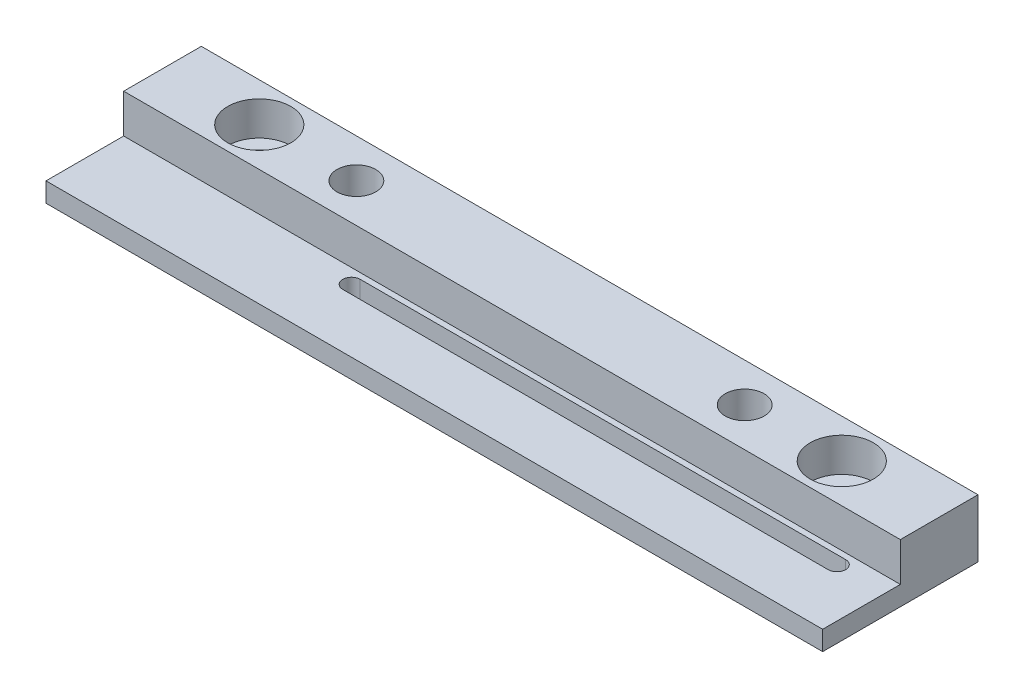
ISO-10303-21;
HEADER;
FILE_DESCRIPTION(('STEP AP214'),'2;1');
FILE_NAME('part.step','',(''),(''),'','','');
FILE_SCHEMA(('AUTOMOTIVE_DESIGN { 1 0 10303 214 1 1 1 1 }'));
ENDSEC;
DATA;
#1=APPLICATION_CONTEXT('core data for automotive mechanical design processes');
#2=APPLICATION_PROTOCOL_DEFINITION('international standard','automotive_design',2000,#1);
#3=PRODUCT_CONTEXT('',#1,'mechanical');
#4=PRODUCT('Part','Part','',(#3));
#5=PRODUCT_RELATED_PRODUCT_CATEGORY('part','',(#4));
#6=PRODUCT_DEFINITION_FORMATION('','',#4);
#7=PRODUCT_DEFINITION_CONTEXT('part definition',#1,'design');
#8=PRODUCT_DEFINITION('design','',#6,#7);
#9=PRODUCT_DEFINITION_SHAPE('','',#8);
#10=(LENGTH_UNIT() NAMED_UNIT(*) SI_UNIT(.MILLI.,.METRE.));
#11=(NAMED_UNIT(*) PLANE_ANGLE_UNIT() SI_UNIT($,.RADIAN.));
#12=(NAMED_UNIT(*) SI_UNIT($,.STERADIAN.) SOLID_ANGLE_UNIT());
#13=UNCERTAINTY_MEASURE_WITH_UNIT(LENGTH_MEASURE(1.E-05),#10,'distance_accuracy_value','');
#14=(GEOMETRIC_REPRESENTATION_CONTEXT(3) GLOBAL_UNCERTAINTY_ASSIGNED_CONTEXT((#13)) GLOBAL_UNIT_ASSIGNED_CONTEXT((#10,
#11,#12)) REPRESENTATION_CONTEXT('',''));
#15=CARTESIAN_POINT('',(0.,0.,0.));
#16=DIRECTION('',(0.,0.,1.));
#17=DIRECTION('',(1.,0.,0.));
#18=AXIS2_PLACEMENT_3D('',#15,#16,#17);
#19=CARTESIAN_POINT('',(80.,-2.27373675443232E-13,16.));
#20=DIRECTION('',(-1.,0.,0.));
#21=DIRECTION('',(0.,0.,1.));
#22=AXIS2_PLACEMENT_3D('',#19,#20,#21);
#23=PLANE('',#22);
#24=DIRECTION('',(0.,1.,0.));
#25=VECTOR('',#24,1.);
#26=CARTESIAN_POINT('',(80.,-2.27373675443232E-13,8.));
#27=LINE('',#26,#25);
#28=CARTESIAN_POINT('',(80.,2.,8.));
#29=VERTEX_POINT('',#28);
#30=CARTESIAN_POINT('',(80.,6.,8.));
#31=VERTEX_POINT('',#30);
#32=EDGE_CURVE('E124',#29,#31,#27,.T.);
#33=ORIENTED_EDGE('',*,*,#32,.F.);
#34=DIRECTION('',(0.,0.,-1.));
#35=VECTOR('',#34,1.);
#36=CARTESIAN_POINT('',(80.,2.,16.));
#37=LINE('',#36,#35);
#38=CARTESIAN_POINT('',(80.,2.,16.));
#39=VERTEX_POINT('',#38);
#40=EDGE_CURVE('E111',#39,#29,#37,.T.);
#41=ORIENTED_EDGE('',*,*,#40,.F.);
#42=DIRECTION('',(0.,1.,0.));
#43=VECTOR('',#42,1.);
#44=CARTESIAN_POINT('',(80.,-2.27373675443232E-13,16.));
#45=LINE('',#44,#43);
#46=CARTESIAN_POINT('',(80.,-2.27373675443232E-13,16.));
#47=VERTEX_POINT('',#46);
#48=EDGE_CURVE('E121',#47,#39,#45,.T.);
#49=ORIENTED_EDGE('',*,*,#48,.F.);
#50=DIRECTION('',(0.,0.,-1.));
#51=VECTOR('',#50,1.);
#52=CARTESIAN_POINT('',(80.,-2.27373675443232E-13,16.));
#53=LINE('',#52,#51);
#54=CARTESIAN_POINT('',(80.,-2.27373675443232E-13,0.));
#55=VERTEX_POINT('',#54);
#56=EDGE_CURVE('E155',#47,#55,#53,.T.);
#57=ORIENTED_EDGE('',*,*,#56,.T.);
#58=DIRECTION('',(0.,1.,0.));
#59=VECTOR('',#58,1.);
#60=CARTESIAN_POINT('',(80.,-2.27373675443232E-13,0.));
#61=LINE('',#60,#59);
#62=CARTESIAN_POINT('',(80.,5.99999999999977,0.));
#63=VERTEX_POINT('',#62);
#64=EDGE_CURVE('E141',#55,#63,#61,.T.);
#65=ORIENTED_EDGE('',*,*,#64,.T.);
#66=DIRECTION('',(0.,0.,-1.));
#67=VECTOR('',#66,1.);
#68=CARTESIAN_POINT('',(80.,5.99999999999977,16.));
#69=LINE('',#68,#67);
#70=EDGE_CURVE('E153',#31,#63,#69,.T.);
#71=ORIENTED_EDGE('',*,*,#70,.F.);
#72=EDGE_LOOP('',(#33,#41,#49,#57,#65,#71));
#73=FACE_BOUND('',#72,.T.);
#74=ADVANCED_FACE('F32',(#73),#23,.F.);
#75=CARTESIAN_POINT('',(0.,5.99999999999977,16.));
#76=DIRECTION('',(0.,-1.,0.));
#77=DIRECTION('',(0.,0.,-1.));
#78=AXIS2_PLACEMENT_3D('',#75,#76,#77);
#79=PLANE('',#78);
#80=CARTESIAN_POINT('',(19.968687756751,5.99999999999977,4.));
#81=DIRECTION('',(0.,1.,0.));
#82=DIRECTION('',(0.,0.,1.));
#83=AXIS2_PLACEMENT_3D('',#80,#81,#82);
#84=CIRCLE('',#83,2.);
#85=CARTESIAN_POINT('',(19.968687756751,5.99999999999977,6.));
#86=VERTEX_POINT('',#85);
#87=EDGE_CURVE('E207',#86,#86,#84,.T.);
#88=ORIENTED_EDGE('',*,*,#87,.F.);
#89=EDGE_LOOP('',(#88));
#90=FACE_BOUND('',#89,.T.);
#91=CARTESIAN_POINT('',(59.968687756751,5.99999999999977,4.));
#92=DIRECTION('',(0.,1.,0.));
#93=DIRECTION('',(0.,0.,1.));
#94=AXIS2_PLACEMENT_3D('',#91,#92,#93);
#95=CIRCLE('',#94,2.);
#96=CARTESIAN_POINT('',(59.968687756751,5.99999999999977,6.));
#97=VERTEX_POINT('',#96);
#98=EDGE_CURVE('E201',#97,#97,#95,.T.);
#99=ORIENTED_EDGE('',*,*,#98,.F.);
#100=EDGE_LOOP('',(#99));
#101=FACE_BOUND('',#100,.T.);
#102=CARTESIAN_POINT('',(9.96868775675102,5.99999999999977,4.));
#103=DIRECTION('',(0.,1.,0.));
#104=DIRECTION('',(0.,0.,1.));
#105=AXIS2_PLACEMENT_3D('',#102,#103,#104);
#106=CIRCLE('',#105,3.25);
#107=CARTESIAN_POINT('',(9.96868775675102,5.99999999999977,7.25));
#108=VERTEX_POINT('',#107);
#109=EDGE_CURVE('E164',#108,#108,#106,.T.);
#110=ORIENTED_EDGE('',*,*,#109,.F.);
#111=EDGE_LOOP('',(#110));
#112=FACE_BOUND('',#111,.T.);
#113=CARTESIAN_POINT('',(69.968687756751,5.99999999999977,4.));
#114=DIRECTION('',(0.,1.,0.));
#115=DIRECTION('',(0.,0.,1.));
#116=AXIS2_PLACEMENT_3D('',#113,#114,#115);
#117=CIRCLE('',#116,3.25);
#118=CARTESIAN_POINT('',(69.968687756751,5.99999999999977,7.25));
#119=VERTEX_POINT('',#118);
#120=EDGE_CURVE('E413',#119,#119,#117,.T.);
#121=ORIENTED_EDGE('',*,*,#120,.F.);
#122=EDGE_LOOP('',(#121));
#123=FACE_BOUND('',#122,.T.);
#124=DIRECTION('',(-1.,0.,0.));
#125=VECTOR('',#124,1.);
#126=CARTESIAN_POINT('',(196.982446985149,6.,8.));
#127=LINE('',#126,#125);
#128=CARTESIAN_POINT('',(0.,6.,8.));
#129=VERTEX_POINT('',#128);
#130=EDGE_CURVE('E404',#31,#129,#127,.T.);
#131=ORIENTED_EDGE('',*,*,#130,.F.);
#132=ORIENTED_EDGE('',*,*,#70,.T.);
#133=DIRECTION('',(-1.,0.,0.));
#134=VECTOR('',#133,1.);
#135=CARTESIAN_POINT('',(0.,5.99999999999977,0.));
#136=LINE('',#135,#134);
#137=CARTESIAN_POINT('',(0.,5.99999999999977,0.));
#138=VERTEX_POINT('',#137);
#139=EDGE_CURVE('E145',#63,#138,#136,.T.);
#140=ORIENTED_EDGE('',*,*,#139,.T.);
#141=DIRECTION('',(0.,0.,-1.));
#142=VECTOR('',#141,1.);
#143=CARTESIAN_POINT('',(0.,5.99999999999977,16.));
#144=LINE('',#143,#142);
#145=EDGE_CURVE('E151',#129,#138,#144,.T.);
#146=ORIENTED_EDGE('',*,*,#145,.F.);
#147=EDGE_LOOP('',(#131,#132,#140,#146));
#148=FACE_BOUND('',#147,.T.);
#149=ADVANCED_FACE('F246',(#90,#101,#112,#123,#148),#79,.F.);
#150=CARTESIAN_POINT('',(0.,-1.13686837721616E-13,16.));
#151=DIRECTION('',(1.,0.,0.));
#152=DIRECTION('',(0.,0.,-1.));
#153=AXIS2_PLACEMENT_3D('',#150,#151,#152);
#154=PLANE('',#153);
#155=DIRECTION('',(0.,-1.,0.));
#156=VECTOR('',#155,1.);
#157=CARTESIAN_POINT('',(0.,-1.13686837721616E-13,8.));
#158=LINE('',#157,#156);
#159=CARTESIAN_POINT('',(0.,2.,8.));
#160=VERTEX_POINT('',#159);
#161=EDGE_CURVE('E11',#129,#160,#158,.T.);
#162=ORIENTED_EDGE('',*,*,#161,.F.);
#163=ORIENTED_EDGE('',*,*,#145,.T.);
#164=DIRECTION('',(0.,-1.,0.));
#165=VECTOR('',#164,1.);
#166=CARTESIAN_POINT('',(0.,-1.13686837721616E-13,0.));
#167=LINE('',#166,#165);
#168=CARTESIAN_POINT('',(0.,-1.13686837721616E-13,0.));
#169=VERTEX_POINT('',#168);
#170=EDGE_CURVE('E134',#138,#169,#167,.T.);
#171=ORIENTED_EDGE('',*,*,#170,.T.);
#172=DIRECTION('',(0.,0.,-1.));
#173=VECTOR('',#172,1.);
#174=CARTESIAN_POINT('',(0.,-1.13686837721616E-13,16.));
#175=LINE('',#174,#173);
#176=CARTESIAN_POINT('',(0.,-1.13686837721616E-13,16.));
#177=VERTEX_POINT('',#176);
#178=EDGE_CURVE('E132',#177,#169,#175,.T.);
#179=ORIENTED_EDGE('',*,*,#178,.F.);
#180=DIRECTION('',(0.,-1.,0.));
#181=VECTOR('',#180,1.);
#182=CARTESIAN_POINT('',(0.,-1.13686837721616E-13,16.));
#183=LINE('',#182,#181);
#184=CARTESIAN_POINT('',(0.,2.,16.));
#185=VERTEX_POINT('',#184);
#186=EDGE_CURVE('E130',#185,#177,#183,.T.);
#187=ORIENTED_EDGE('',*,*,#186,.F.);
#188=DIRECTION('',(0.,0.,1.));
#189=VECTOR('',#188,1.);
#190=CARTESIAN_POINT('',(0.,2.,16.));
#191=LINE('',#190,#189);
#192=EDGE_CURVE('E47',#160,#185,#191,.T.);
#193=ORIENTED_EDGE('',*,*,#192,.F.);
#194=EDGE_LOOP('',(#162,#163,#171,#179,#187,#193));
#195=FACE_BOUND('',#194,.T.);
#196=ADVANCED_FACE('F250',(#195),#154,.F.);
#197=CARTESIAN_POINT('',(80.,-2.27373675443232E-13,16.));
#198=DIRECTION('',(0.,0.,1.));
#199=DIRECTION('',(1.,0.,0.));
#200=AXIS2_PLACEMENT_3D('',#197,#198,#199);
#201=PLANE('',#200);
#202=ORIENTED_EDGE('',*,*,#48,.T.);
#203=DIRECTION('',(-1.,0.,0.));
#204=VECTOR('',#203,1.);
#205=CARTESIAN_POINT('',(196.982446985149,2.,16.));
#206=LINE('',#205,#204);
#207=EDGE_CURVE('E108',#39,#185,#206,.T.);
#208=ORIENTED_EDGE('',*,*,#207,.T.);
#209=ORIENTED_EDGE('',*,*,#186,.T.);
#210=DIRECTION('',(1.,0.,0.));
#211=VECTOR('',#210,1.);
#212=CARTESIAN_POINT('',(0.,-1.13686837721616E-13,16.));
#213=LINE('',#212,#211);
#214=EDGE_CURVE('E128',#177,#47,#213,.T.);
#215=ORIENTED_EDGE('',*,*,#214,.T.);
#216=EDGE_LOOP('',(#202,#208,#209,#215));
#217=FACE_BOUND('',#216,.T.);
#218=ADVANCED_FACE('F126',(#217),#201,.T.);
#219=CARTESIAN_POINT('',(74.968687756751,-10.0000000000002,9.5));
#220=DIRECTION('',(0.,1.,0.));
#221=DIRECTION('',(0.,0.,1.));
#222=AXIS2_PLACEMENT_3D('',#219,#220,#221);
#223=CYLINDRICAL_SURFACE('',#222,0.899999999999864);
#224=CARTESIAN_POINT('',(74.968687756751,2.,9.5));
#225=DIRECTION('',(0.,1.,0.));
#226=DIRECTION('',(0.,0.,1.));
#227=AXIS2_PLACEMENT_3D('',#224,#225,#226);
#228=CIRCLE('',#227,0.899999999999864);
#229=CARTESIAN_POINT('',(74.968687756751,2.,8.60000000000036));
#230=VERTEX_POINT('',#229);
#231=CARTESIAN_POINT('',(74.968687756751,2.,10.4000000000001));
#232=VERTEX_POINT('',#231);
#233=EDGE_CURVE('E171',#230,#232,#228,.F.);
#234=ORIENTED_EDGE('',*,*,#233,.F.);
#235=DIRECTION('',(0.,1.,0.));
#236=VECTOR('',#235,1.);
#237=CARTESIAN_POINT('',(74.968687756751,-10.0000000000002,8.60000000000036));
#238=LINE('',#237,#236);
#239=CARTESIAN_POINT('',(74.968687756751,-1.83880688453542E-13,8.60000000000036));
#240=VERTEX_POINT('',#239);
#241=EDGE_CURVE('E160',#240,#230,#238,.T.);
#242=ORIENTED_EDGE('',*,*,#241,.F.);
#243=CARTESIAN_POINT('',(74.968687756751,-2.20309881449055E-13,9.5));
#244=DIRECTION('',(0.,1.,0.));
#245=DIRECTION('',(-1.,0.,0.));
#246=AXIS2_PLACEMENT_3D('',#243,#244,#245);
#247=CIRCLE('',#246,0.899999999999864);
#248=CARTESIAN_POINT('',(74.968687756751,-1.83880688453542E-13,10.4000000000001));
#249=VERTEX_POINT('',#248);
#250=EDGE_CURVE('E198',#249,#240,#247,.T.);
#251=ORIENTED_EDGE('',*,*,#250,.F.);
#252=DIRECTION('',(0.,1.,0.));
#253=VECTOR('',#252,1.);
#254=CARTESIAN_POINT('',(74.968687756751,-10.0000000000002,10.4000000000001));
#255=LINE('',#254,#253);
#256=EDGE_CURVE('E187',#249,#232,#255,.T.);
#257=ORIENTED_EDGE('',*,*,#256,.T.);
#258=EDGE_LOOP('',(#234,#242,#251,#257));
#259=FACE_BOUND('',#258,.T.);
#260=ADVANCED_FACE('F262',(#259),#223,.F.);
#261=CARTESIAN_POINT('',(24.968687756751,-10.0000000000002,10.4));
#262=DIRECTION('',(0.,0.,1.));
#263=DIRECTION('',(1.,0.,0.));
#264=AXIS2_PLACEMENT_3D('',#261,#262,#263);
#265=PLANE('',#264);
#266=DIRECTION('',(-1.,0.,0.));
#267=VECTOR('',#266,1.);
#268=CARTESIAN_POINT('',(24.968687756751,2.,10.4));
#269=LINE('',#268,#267);
#270=CARTESIAN_POINT('',(24.968687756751,2.,10.3999999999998));
#271=VERTEX_POINT('',#270);
#272=EDGE_CURVE('E55',#232,#271,#269,.T.);
#273=ORIENTED_EDGE('',*,*,#272,.F.);
#274=ORIENTED_EDGE('',*,*,#256,.F.);
#275=DIRECTION('',(1.,0.,0.));
#276=VECTOR('',#275,1.);
#277=CARTESIAN_POINT('',(0.,-1.13686837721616E-13,10.3999999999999));
#278=LINE('',#277,#276);
#279=CARTESIAN_POINT('',(24.968687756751,-1.47451495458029E-13,10.3999999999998));
#280=VERTEX_POINT('',#279);
#281=EDGE_CURVE('E195',#280,#249,#278,.T.);
#282=ORIENTED_EDGE('',*,*,#281,.F.);
#283=DIRECTION('',(0.,1.,0.));
#284=VECTOR('',#283,1.);
#285=CARTESIAN_POINT('',(24.968687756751,-10.0000000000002,10.3999999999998));
#286=LINE('',#285,#284);
#287=EDGE_CURVE('E185',#280,#271,#286,.T.);
#288=ORIENTED_EDGE('',*,*,#287,.T.);
#289=EDGE_LOOP('',(#273,#274,#282,#288));
#290=FACE_BOUND('',#289,.T.);
#291=ADVANCED_FACE('F272',(#290),#265,.F.);
#292=CARTESIAN_POINT('',(24.968687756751,-10.0000000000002,9.5));
#293=DIRECTION('',(0.,1.,0.));
#294=DIRECTION('',(0.,0.,1.));
#295=AXIS2_PLACEMENT_3D('',#292,#293,#294);
#296=CYLINDRICAL_SURFACE('',#295,0.899999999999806);
#297=CARTESIAN_POINT('',(24.968687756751,2.,9.5));
#298=DIRECTION('',(0.,1.,0.));
#299=DIRECTION('',(0.,0.,1.));
#300=AXIS2_PLACEMENT_3D('',#297,#298,#299);
#301=CIRCLE('',#300,0.899999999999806);
#302=CARTESIAN_POINT('',(24.968687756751,2.,8.60000000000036));
#303=VERTEX_POINT('',#302);
#304=EDGE_CURVE('E172',#271,#303,#301,.F.);
#305=ORIENTED_EDGE('',*,*,#304,.F.);
#306=ORIENTED_EDGE('',*,*,#287,.F.);
#307=CARTESIAN_POINT('',(24.968687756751,-1.49186218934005E-13,9.5));
#308=DIRECTION('',(0.,1.,0.));
#309=DIRECTION('',(-1.,0.,0.));
#310=AXIS2_PLACEMENT_3D('',#307,#308,#309);
#311=CIRCLE('',#310,0.899999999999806);
#312=CARTESIAN_POINT('',(24.968687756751,-1.49169477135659E-13,8.60000000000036));
#313=VERTEX_POINT('',#312);
#314=EDGE_CURVE('E183',#313,#280,#311,.T.);
#315=ORIENTED_EDGE('',*,*,#314,.F.);
#316=DIRECTION('',(0.,1.,0.));
#317=VECTOR('',#316,1.);
#318=CARTESIAN_POINT('',(24.968687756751,-10.0000000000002,8.60000000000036));
#319=LINE('',#318,#317);
#320=EDGE_CURVE('E176',#313,#303,#319,.T.);
#321=ORIENTED_EDGE('',*,*,#320,.T.);
#322=EDGE_LOOP('',(#305,#306,#315,#321));
#323=FACE_BOUND('',#322,.T.);
#324=ADVANCED_FACE('F180',(#323),#296,.F.);
#325=CARTESIAN_POINT('',(74.968687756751,-10.0000000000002,8.60000000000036));
#326=DIRECTION('',(0.,0.,-1.));
#327=DIRECTION('',(-1.,0.,0.));
#328=AXIS2_PLACEMENT_3D('',#325,#326,#327);
#329=PLANE('',#328);
#330=DIRECTION('',(1.,0.,0.));
#331=VECTOR('',#330,1.);
#332=CARTESIAN_POINT('',(74.968687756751,2.,8.60000000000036));
#333=LINE('',#332,#331);
#334=EDGE_CURVE('E40',#303,#230,#333,.T.);
#335=ORIENTED_EDGE('',*,*,#334,.F.);
#336=ORIENTED_EDGE('',*,*,#320,.F.);
#337=DIRECTION('',(-1.,0.,0.));
#338=VECTOR('',#337,1.);
#339=CARTESIAN_POINT('',(0.,-1.13686837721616E-13,8.60000000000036));
#340=LINE('',#339,#338);
#341=EDGE_CURVE('E192',#240,#313,#340,.T.);
#342=ORIENTED_EDGE('',*,*,#341,.F.);
#343=ORIENTED_EDGE('',*,*,#241,.T.);
#344=EDGE_LOOP('',(#335,#336,#342,#343));
#345=FACE_BOUND('',#344,.T.);
#346=ADVANCED_FACE('F175',(#345),#329,.F.);
#347=CARTESIAN_POINT('',(69.968687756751,-10.0000000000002,4.));
#348=DIRECTION('',(0.,1.,0.));
#349=DIRECTION('',(0.,0.,1.));
#350=AXIS2_PLACEMENT_3D('',#347,#348,#349);
#351=CYLINDRICAL_SURFACE('',#350,1.75);
#352=CARTESIAN_POINT('',(69.968687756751,-2.13370987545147E-13,4.));
#353=DIRECTION('',(0.,1.,0.));
#354=DIRECTION('',(-1.,0.,0.));
#355=AXIS2_PLACEMENT_3D('',#352,#353,#354);
#356=CIRCLE('',#355,1.75);
#357=CARTESIAN_POINT('',(68.218687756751,-2.10884087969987E-13,4.));
#358=VERTEX_POINT('',#357);
#359=EDGE_CURVE('E213',#358,#358,#356,.T.);
#360=ORIENTED_EDGE('',*,*,#359,.F.);
#361=EDGE_LOOP('',(#360));
#362=FACE_BOUND('',#361,.T.);
#363=CARTESIAN_POINT('',(69.968687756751,2.49999999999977,4.));
#364=DIRECTION('',(0.,1.,0.));
#365=DIRECTION('',(0.,0.,1.));
#366=AXIS2_PLACEMENT_3D('',#363,#364,#365);
#367=CIRCLE('',#366,1.75);
#368=CARTESIAN_POINT('',(69.968687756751,2.49999999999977,5.75));
#369=VERTEX_POINT('',#368);
#370=EDGE_CURVE('E162',#369,#369,#367,.F.);
#371=ORIENTED_EDGE('',*,*,#370,.F.);
#372=EDGE_LOOP('',(#371));
#373=FACE_BOUND('',#372,.T.);
#374=ADVANCED_FACE('F223',(#362,#373),#351,.F.);
#375=CARTESIAN_POINT('',(9.96868775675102,-10.0000000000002,4.));
#376=DIRECTION('',(0.,1.,0.));
#377=DIRECTION('',(0.,0.,1.));
#378=AXIS2_PLACEMENT_3D('',#375,#376,#377);
#379=CYLINDRICAL_SURFACE('',#378,1.75);
#380=CARTESIAN_POINT('',(9.96868775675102,-1.28369537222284E-13,4.));
#381=DIRECTION('',(0.,1.,0.));
#382=DIRECTION('',(-1.,0.,0.));
#383=AXIS2_PLACEMENT_3D('',#380,#381,#382);
#384=CIRCLE('',#383,1.75);
#385=CARTESIAN_POINT('',(8.21868775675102,-1.25882637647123E-13,4.));
#386=VERTEX_POINT('',#385);
#387=EDGE_CURVE('E142',#386,#386,#384,.T.);
#388=ORIENTED_EDGE('',*,*,#387,.F.);
#389=EDGE_LOOP('',(#388));
#390=FACE_BOUND('',#389,.T.);
#391=CARTESIAN_POINT('',(9.96868775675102,2.49999999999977,4.));
#392=DIRECTION('',(0.,1.,0.));
#393=DIRECTION('',(0.,0.,1.));
#394=AXIS2_PLACEMENT_3D('',#391,#392,#393);
#395=CIRCLE('',#394,1.75);
#396=CARTESIAN_POINT('',(9.96868775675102,2.49999999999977,5.75));
#397=VERTEX_POINT('',#396);
#398=EDGE_CURVE('E157',#397,#397,#395,.F.);
#399=ORIENTED_EDGE('',*,*,#398,.F.);
#400=EDGE_LOOP('',(#399));
#401=FACE_BOUND('',#400,.T.);
#402=ADVANCED_FACE('F220',(#390,#401),#379,.F.);
#403=CARTESIAN_POINT('',(0.,-1.13686837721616E-13,16.));
#404=DIRECTION('',(0.,1.,0.));
#405=DIRECTION('',(-1.,0.,0.));
#406=AXIS2_PLACEMENT_3D('',#403,#404,#405);
#407=PLANE('',#406);
#408=ORIENTED_EDGE('',*,*,#281,.T.);
#409=ORIENTED_EDGE('',*,*,#250,.T.);
#410=ORIENTED_EDGE('',*,*,#341,.T.);
#411=ORIENTED_EDGE('',*,*,#314,.T.);
#412=EDGE_LOOP('',(#408,#409,#410,#411));
#413=FACE_BOUND('',#412,.T.);
#414=CARTESIAN_POINT('',(59.968687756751,-1.99493199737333E-13,4.));
#415=DIRECTION('',(0.,1.,0.));
#416=DIRECTION('',(-1.,0.,0.));
#417=AXIS2_PLACEMENT_3D('',#414,#415,#416);
#418=CIRCLE('',#417,2.);
#419=CARTESIAN_POINT('',(57.968687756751,-1.96651028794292E-13,4.));
#420=VERTEX_POINT('',#419);
#421=EDGE_CURVE('E204',#420,#420,#418,.T.);
#422=ORIENTED_EDGE('',*,*,#421,.T.);
#423=EDGE_LOOP('',(#422));
#424=FACE_BOUND('',#423,.T.);
#425=CARTESIAN_POINT('',(19.968687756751,-1.42247325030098E-13,4.));
#426=DIRECTION('',(0.,1.,0.));
#427=DIRECTION('',(-1.,0.,0.));
#428=AXIS2_PLACEMENT_3D('',#425,#426,#427);
#429=CIRCLE('',#428,2.);
#430=CARTESIAN_POINT('',(17.968687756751,-1.39405154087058E-13,4.));
#431=VERTEX_POINT('',#430);
#432=EDGE_CURVE('E210',#431,#431,#429,.T.);
#433=ORIENTED_EDGE('',*,*,#432,.T.);
#434=EDGE_LOOP('',(#433));
#435=FACE_BOUND('',#434,.T.);
#436=ORIENTED_EDGE('',*,*,#359,.T.);
#437=EDGE_LOOP('',(#436));
#438=FACE_BOUND('',#437,.T.);
#439=ORIENTED_EDGE('',*,*,#387,.T.);
#440=EDGE_LOOP('',(#439));
#441=FACE_BOUND('',#440,.T.);
#442=DIRECTION('',(1.,0.,0.));
#443=VECTOR('',#442,1.);
#444=CARTESIAN_POINT('',(0.,-1.13686837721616E-13,0.));
#445=LINE('',#444,#443);
#446=EDGE_CURVE('E138',#169,#55,#445,.T.);
#447=ORIENTED_EDGE('',*,*,#446,.T.);
#448=ORIENTED_EDGE('',*,*,#56,.F.);
#449=ORIENTED_EDGE('',*,*,#214,.F.);
#450=ORIENTED_EDGE('',*,*,#178,.T.);
#451=EDGE_LOOP('',(#447,#448,#449,#450));
#452=FACE_BOUND('',#451,.T.);
#453=ADVANCED_FACE('F34',(#413,#424,#435,#438,#441,#452),#407,.F.);
#454=CARTESIAN_POINT('',(80.,-2.27373675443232E-13,0.));
#455=DIRECTION('',(0.,0.,1.));
#456=DIRECTION('',(1.,0.,0.));
#457=AXIS2_PLACEMENT_3D('',#454,#455,#456);
#458=PLANE('',#457);
#459=ORIENTED_EDGE('',*,*,#446,.F.);
#460=ORIENTED_EDGE('',*,*,#170,.F.);
#461=ORIENTED_EDGE('',*,*,#139,.F.);
#462=ORIENTED_EDGE('',*,*,#64,.F.);
#463=EDGE_LOOP('',(#459,#460,#461,#462));
#464=FACE_BOUND('',#463,.T.);
#465=ADVANCED_FACE('F257',(#464),#458,.F.);
#466=CARTESIAN_POINT('',(19.968687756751,-10.0000000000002,4.));
#467=DIRECTION('',(0.,1.,0.));
#468=DIRECTION('',(0.,0.,1.));
#469=AXIS2_PLACEMENT_3D('',#466,#467,#468);
#470=CYLINDRICAL_SURFACE('',#469,2.);
#471=ORIENTED_EDGE('',*,*,#87,.T.);
#472=EDGE_LOOP('',(#471));
#473=FACE_BOUND('',#472,.T.);
#474=ORIENTED_EDGE('',*,*,#432,.F.);
#475=EDGE_LOOP('',(#474));
#476=FACE_BOUND('',#475,.T.);
#477=ADVANCED_FACE('F240',(#473,#476),#470,.F.);
#478=CARTESIAN_POINT('',(59.968687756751,-10.0000000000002,4.));
#479=DIRECTION('',(0.,1.,0.));
#480=DIRECTION('',(0.,0.,1.));
#481=AXIS2_PLACEMENT_3D('',#478,#479,#480);
#482=CYLINDRICAL_SURFACE('',#481,2.);
#483=ORIENTED_EDGE('',*,*,#98,.T.);
#484=EDGE_LOOP('',(#483));
#485=FACE_BOUND('',#484,.T.);
#486=ORIENTED_EDGE('',*,*,#421,.F.);
#487=EDGE_LOOP('',(#486));
#488=FACE_BOUND('',#487,.T.);
#489=ADVANCED_FACE('F230',(#485,#488),#482,.F.);
#490=CARTESIAN_POINT('',(9.96868775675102,2.49999999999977,4.));
#491=DIRECTION('',(0.,1.,0.));
#492=DIRECTION('',(0.,0.,1.));
#493=AXIS2_PLACEMENT_3D('',#490,#491,#492);
#494=PLANE('',#493);
#495=CARTESIAN_POINT('',(9.96868775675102,2.49999999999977,4.));
#496=DIRECTION('',(0.,1.,0.));
#497=DIRECTION('',(0.,0.,1.));
#498=AXIS2_PLACEMENT_3D('',#495,#496,#497);
#499=CIRCLE('',#498,3.25);
#500=CARTESIAN_POINT('',(9.96868775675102,2.49999999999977,7.25));
#501=VERTEX_POINT('',#500);
#502=EDGE_CURVE('E161',#501,#501,#499,.T.);
#503=ORIENTED_EDGE('',*,*,#502,.T.);
#504=EDGE_LOOP('',(#503));
#505=FACE_BOUND('',#504,.T.);
#506=ORIENTED_EDGE('',*,*,#398,.T.);
#507=EDGE_LOOP('',(#506));
#508=FACE_BOUND('',#507,.T.);
#509=ADVANCED_FACE('F227',(#505,#508),#494,.T.);
#510=CARTESIAN_POINT('',(9.96868775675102,2.49999999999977,4.));
#511=DIRECTION('',(0.,1.,0.));
#512=DIRECTION('',(0.,0.,1.));
#513=AXIS2_PLACEMENT_3D('',#510,#511,#512);
#514=CYLINDRICAL_SURFACE('',#513,3.25);
#515=ORIENTED_EDGE('',*,*,#502,.F.);
#516=EDGE_LOOP('',(#515));
#517=FACE_BOUND('',#516,.T.);
#518=ORIENTED_EDGE('',*,*,#109,.T.);
#519=EDGE_LOOP('',(#518));
#520=FACE_BOUND('',#519,.T.);
#521=ADVANCED_FACE('F229',(#517,#520),#514,.F.);
#522=CARTESIAN_POINT('',(69.968687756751,2.49999999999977,4.));
#523=DIRECTION('',(0.,1.,0.));
#524=DIRECTION('',(0.,0.,1.));
#525=AXIS2_PLACEMENT_3D('',#522,#523,#524);
#526=PLANE('',#525);
#527=CARTESIAN_POINT('',(69.968687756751,2.49999999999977,4.));
#528=DIRECTION('',(0.,1.,0.));
#529=DIRECTION('',(0.,0.,1.));
#530=AXIS2_PLACEMENT_3D('',#527,#528,#529);
#531=CIRCLE('',#530,3.25);
#532=CARTESIAN_POINT('',(69.968687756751,2.49999999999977,7.25));
#533=VERTEX_POINT('',#532);
#534=EDGE_CURVE('E165',#533,#533,#531,.T.);
#535=ORIENTED_EDGE('',*,*,#534,.T.);
#536=EDGE_LOOP('',(#535));
#537=FACE_BOUND('',#536,.T.);
#538=ORIENTED_EDGE('',*,*,#370,.T.);
#539=EDGE_LOOP('',(#538));
#540=FACE_BOUND('',#539,.T.);
#541=ADVANCED_FACE('F237',(#537,#540),#526,.T.);
#542=CARTESIAN_POINT('',(69.968687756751,2.49999999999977,4.));
#543=DIRECTION('',(0.,1.,0.));
#544=DIRECTION('',(0.,0.,1.));
#545=AXIS2_PLACEMENT_3D('',#542,#543,#544);
#546=CYLINDRICAL_SURFACE('',#545,3.25);
#547=ORIENTED_EDGE('',*,*,#534,.F.);
#548=EDGE_LOOP('',(#547));
#549=FACE_BOUND('',#548,.T.);
#550=ORIENTED_EDGE('',*,*,#120,.T.);
#551=EDGE_LOOP('',(#550));
#552=FACE_BOUND('',#551,.T.);
#553=ADVANCED_FACE('F343',(#549,#552),#546,.F.);
#554=CARTESIAN_POINT('',(196.982446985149,2.,8.));
#555=DIRECTION('',(0.,0.,1.));
#556=DIRECTION('',(1.,0.,0.));
#557=AXIS2_PLACEMENT_3D('',#554,#555,#556);
#558=PLANE('',#557);
#559=DIRECTION('',(-1.,0.,0.));
#560=VECTOR('',#559,1.);
#561=CARTESIAN_POINT('',(196.982446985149,2.,8.));
#562=LINE('',#561,#560);
#563=EDGE_CURVE('E116',#29,#160,#562,.T.);
#564=ORIENTED_EDGE('',*,*,#563,.F.);
#565=ORIENTED_EDGE('',*,*,#32,.T.);
#566=ORIENTED_EDGE('',*,*,#130,.T.);
#567=ORIENTED_EDGE('',*,*,#161,.T.);
#568=EDGE_LOOP('',(#564,#565,#566,#567));
#569=FACE_BOUND('',#568,.T.);
#570=ADVANCED_FACE('F351',(#569),#558,.T.);
#571=CARTESIAN_POINT('',(196.982446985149,2.,16.));
#572=DIRECTION('',(0.,1.,0.));
#573=DIRECTION('',(0.,0.,1.));
#574=AXIS2_PLACEMENT_3D('',#571,#572,#573);
#575=PLANE('',#574);
#576=ORIENTED_EDGE('',*,*,#334,.T.);
#577=ORIENTED_EDGE('',*,*,#233,.T.);
#578=ORIENTED_EDGE('',*,*,#272,.T.);
#579=ORIENTED_EDGE('',*,*,#304,.T.);
#580=EDGE_LOOP('',(#576,#577,#578,#579));
#581=FACE_BOUND('',#580,.T.);
#582=ORIENTED_EDGE('',*,*,#207,.F.);
#583=ORIENTED_EDGE('',*,*,#40,.T.);
#584=ORIENTED_EDGE('',*,*,#563,.T.);
#585=ORIENTED_EDGE('',*,*,#192,.T.);
#586=EDGE_LOOP('',(#582,#583,#584,#585));
#587=FACE_BOUND('',#586,.T.);
#588=ADVANCED_FACE('F110',(#581,#587),#575,.T.);
#589=CLOSED_SHELL('',(#74,#149,#196,#218,#260,#291,#324,#346,#374,#402,#453,#465,#477,#489,#509,
#521,#541,#553,#570,#588));
#590=MANIFOLD_SOLID_BREP('B2',#589);
#591=ADVANCED_BREP_SHAPE_REPRESENTATION('',(#18,#590),#14);
#592=SHAPE_DEFINITION_REPRESENTATION(#9,#591);
ENDSEC;
END-ISO-10303-21;
